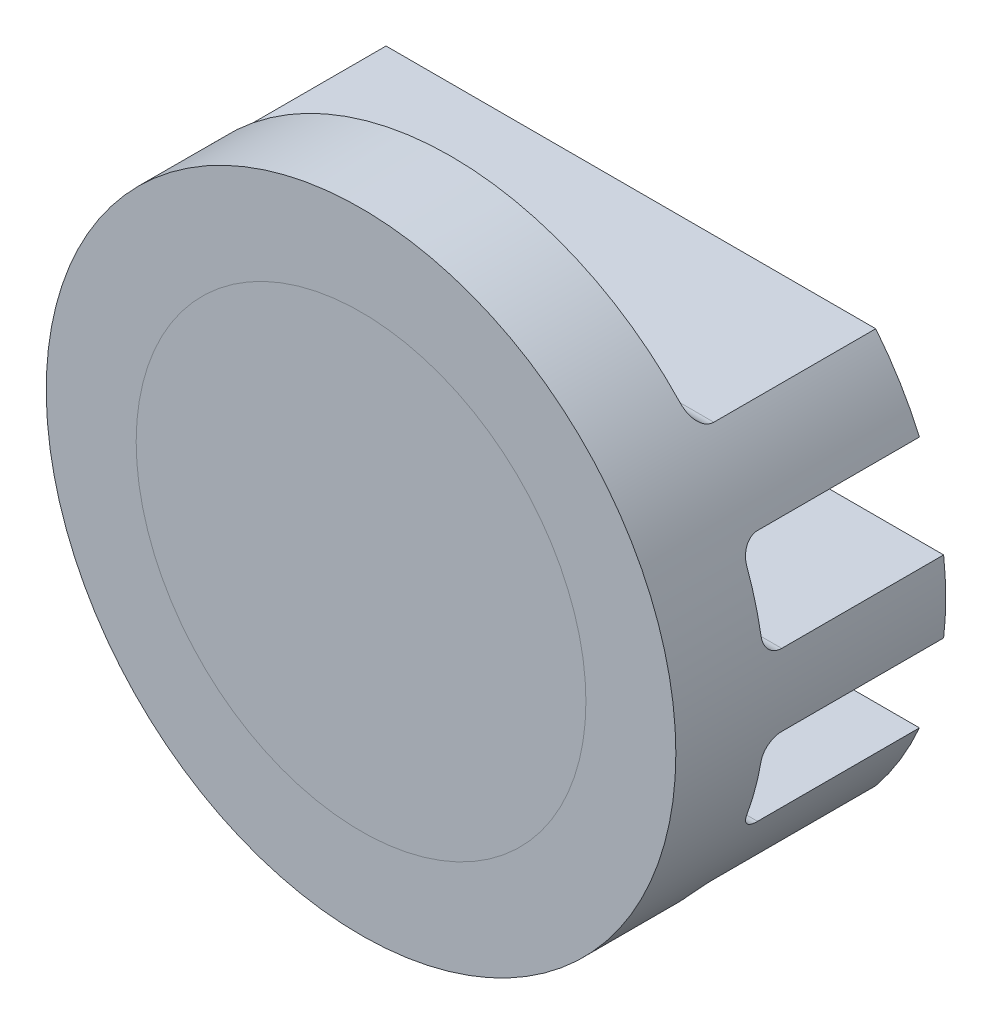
ISO-10303-21;
HEADER;
FILE_DESCRIPTION(('STEP AP214'),'2;1');
FILE_NAME('part.step','',(''),(''),'','','');
FILE_SCHEMA(('AUTOMOTIVE_DESIGN { 1 0 10303 214 1 1 1 1 }'));
ENDSEC;
DATA;
#1=APPLICATION_CONTEXT('core data for automotive mechanical design processes');
#2=APPLICATION_PROTOCOL_DEFINITION('international standard','automotive_design',2000,#1);
#3=PRODUCT_CONTEXT('',#1,'mechanical');
#4=PRODUCT('Part','Part','',(#3));
#5=PRODUCT_RELATED_PRODUCT_CATEGORY('part','',(#4));
#6=PRODUCT_DEFINITION_FORMATION('','',#4);
#7=PRODUCT_DEFINITION_CONTEXT('part definition',#1,'design');
#8=PRODUCT_DEFINITION('design','',#6,#7);
#9=PRODUCT_DEFINITION_SHAPE('','',#8);
#10=(LENGTH_UNIT() NAMED_UNIT(*) SI_UNIT(.MILLI.,.METRE.));
#11=(NAMED_UNIT(*) PLANE_ANGLE_UNIT() SI_UNIT($,.RADIAN.));
#12=(NAMED_UNIT(*) SI_UNIT($,.STERADIAN.) SOLID_ANGLE_UNIT());
#13=UNCERTAINTY_MEASURE_WITH_UNIT(LENGTH_MEASURE(1.E-05),#10,'distance_accuracy_value','');
#14=(GEOMETRIC_REPRESENTATION_CONTEXT(3) GLOBAL_UNCERTAINTY_ASSIGNED_CONTEXT((#13)) GLOBAL_UNIT_ASSIGNED_CONTEXT((#10,
#11,#12)) REPRESENTATION_CONTEXT('',''));
#15=CARTESIAN_POINT('',(0.,0.,0.));
#16=DIRECTION('',(0.,0.,1.));
#17=DIRECTION('',(1.,0.,0.));
#18=AXIS2_PLACEMENT_3D('',#15,#16,#17);
#19=CARTESIAN_POINT('',(0.,0.,10.));
#20=DIRECTION('',(0.,0.,1.));
#21=DIRECTION('',(1.,0.,0.));
#22=AXIS2_PLACEMENT_3D('',#19,#20,#21);
#23=PLANE('',#22);
#24=CARTESIAN_POINT('',(0.,0.,10.));
#25=DIRECTION('',(0.,0.,1.));
#26=DIRECTION('',(1.,0.,0.));
#27=AXIS2_PLACEMENT_3D('',#24,#25,#26);
#28=CIRCLE('',#27,35.);
#29=CARTESIAN_POINT('',(35.,0.,10.));
#30=VERTEX_POINT('',#29);
#31=EDGE_CURVE('E199',#30,#30,#28,.T.);
#32=ORIENTED_EDGE('',*,*,#31,.T.);
#33=EDGE_LOOP('',(#32));
#34=FACE_BOUND('',#33,.T.);
#35=CARTESIAN_POINT('',(0.,0.,10.));
#36=DIRECTION('',(0.,0.,1.));
#37=DIRECTION('',(1.,0.,0.));
#38=AXIS2_PLACEMENT_3D('',#35,#36,#37);
#39=CIRCLE('',#38,25.);
#40=CARTESIAN_POINT('',(25.,0.,10.));
#41=VERTEX_POINT('',#40);
#42=EDGE_CURVE('E12',#41,#41,#39,.F.);
#43=ORIENTED_EDGE('',*,*,#42,.T.);
#44=EDGE_LOOP('',(#43));
#45=FACE_BOUND('',#44,.T.);
#46=ADVANCED_FACE('F35',(#34,#45),#23,.T.);
#47=CARTESIAN_POINT('',(43.,-4.,-20.));
#48=DIRECTION('',(0.,1.,0.));
#49=DIRECTION('',(0.,0.,1.));
#50=AXIS2_PLACEMENT_3D('',#47,#48,#49);
#51=PLANE('',#50);
#52=DIRECTION('',(0.,0.,1.));
#53=VECTOR('',#52,1.);
#54=CARTESIAN_POINT('',(34.7706773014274,-4.,-20.));
#55=LINE('',#54,#53);
#56=CARTESIAN_POINT('',(34.7706773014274,-4.,-2.));
#57=VERTEX_POINT('',#56);
#58=CARTESIAN_POINT('',(34.7706773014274,-4.,-20.));
#59=VERTEX_POINT('',#58);
#60=EDGE_CURVE('E165',#57,#59,#55,.F.);
#61=ORIENTED_EDGE('',*,*,#60,.F.);
#62=DIRECTION('',(-1.,0.,0.));
#63=VECTOR('',#62,1.);
#64=CARTESIAN_POINT('',(-34.7706773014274,-4.,-2.));
#65=LINE('',#64,#63);
#66=CARTESIAN_POINT('',(-34.7706773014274,-4.,-2.));
#67=VERTEX_POINT('',#66);
#68=EDGE_CURVE('E220',#57,#67,#65,.T.);
#69=ORIENTED_EDGE('',*,*,#68,.T.);
#70=DIRECTION('',(0.,0.,1.));
#71=VECTOR('',#70,1.);
#72=CARTESIAN_POINT('',(-34.7706773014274,-4.,-20.));
#73=LINE('',#72,#71);
#74=CARTESIAN_POINT('',(-34.7706773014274,-4.,-20.));
#75=VERTEX_POINT('',#74);
#76=EDGE_CURVE('E528',#75,#67,#73,.T.);
#77=ORIENTED_EDGE('',*,*,#76,.F.);
#78=DIRECTION('',(-1.,0.,0.));
#79=VECTOR('',#78,1.);
#80=CARTESIAN_POINT('',(43.,-4.,-20.));
#81=LINE('',#80,#79);
#82=EDGE_CURVE('E187',#59,#75,#81,.T.);
#83=ORIENTED_EDGE('',*,*,#82,.F.);
#84=EDGE_LOOP('',(#61,#69,#77,#83));
#85=FACE_BOUND('',#84,.T.);
#86=ADVANCED_FACE('F284',(#85),#51,.F.);
#87=CARTESIAN_POINT('',(43.,4.,-20.));
#88=DIRECTION('',(0.,-1.,0.));
#89=DIRECTION('',(0.,0.,-1.));
#90=AXIS2_PLACEMENT_3D('',#87,#88,#89);
#91=PLANE('',#90);
#92=DIRECTION('',(0.,0.,1.));
#93=VECTOR('',#92,1.);
#94=CARTESIAN_POINT('',(-34.7706773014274,4.,-20.));
#95=LINE('',#94,#93);
#96=CARTESIAN_POINT('',(-34.7706773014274,4.,-2.));
#97=VERTEX_POINT('',#96);
#98=CARTESIAN_POINT('',(-34.7706773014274,4.,-20.));
#99=VERTEX_POINT('',#98);
#100=EDGE_CURVE('E516',#97,#99,#95,.F.);
#101=ORIENTED_EDGE('',*,*,#100,.F.);
#102=DIRECTION('',(1.,0.,0.));
#103=VECTOR('',#102,1.);
#104=CARTESIAN_POINT('',(34.7706773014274,4.,-2.));
#105=LINE('',#104,#103);
#106=CARTESIAN_POINT('',(34.7706773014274,4.,-2.));
#107=VERTEX_POINT('',#106);
#108=EDGE_CURVE('E180',#97,#107,#105,.T.);
#109=ORIENTED_EDGE('',*,*,#108,.T.);
#110=DIRECTION('',(0.,0.,1.));
#111=VECTOR('',#110,1.);
#112=CARTESIAN_POINT('',(34.7706773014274,4.,-20.));
#113=LINE('',#112,#111);
#114=CARTESIAN_POINT('',(34.7706773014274,4.,-20.));
#115=VERTEX_POINT('',#114);
#116=EDGE_CURVE('E163',#115,#107,#113,.T.);
#117=ORIENTED_EDGE('',*,*,#116,.F.);
#118=DIRECTION('',(1.,0.,0.));
#119=VECTOR('',#118,1.);
#120=CARTESIAN_POINT('',(43.,4.,-20.));
#121=LINE('',#120,#119);
#122=EDGE_CURVE('E178',#99,#115,#121,.T.);
#123=ORIENTED_EDGE('',*,*,#122,.F.);
#124=EDGE_LOOP('',(#101,#109,#117,#123));
#125=FACE_BOUND('',#124,.T.);
#126=ADVANCED_FACE('F177',(#125),#91,.F.);
#127=CARTESIAN_POINT('',(43.,4.,-20.));
#128=DIRECTION('',(0.,0.,1.));
#129=DIRECTION('',(1.,0.,0.));
#130=AXIS2_PLACEMENT_3D('',#127,#128,#129);
#131=PLANE('',#130);
#132=CARTESIAN_POINT('',(0.,0.,-20.));
#133=DIRECTION('',(0.,0.,1.));
#134=DIRECTION('',(1.,0.,0.));
#135=AXIS2_PLACEMENT_3D('',#132,#133,#134);
#136=CIRCLE('',#135,35.);
#137=EDGE_CURVE('E170',#99,#75,#136,.T.);
#138=ORIENTED_EDGE('',*,*,#137,.F.);
#139=ORIENTED_EDGE('',*,*,#122,.T.);
#140=EDGE_CURVE('E161',#59,#115,#136,.T.);
#141=ORIENTED_EDGE('',*,*,#140,.F.);
#142=ORIENTED_EDGE('',*,*,#82,.T.);
#143=EDGE_LOOP('',(#138,#139,#141,#142));
#144=FACE_BOUND('',#143,.T.);
#145=ADVANCED_FACE('F185',(#144),#131,.F.);
#146=CARTESIAN_POINT('',(43.,14.,-20.));
#147=DIRECTION('',(0.,1.,0.));
#148=DIRECTION('',(0.,0.,1.));
#149=AXIS2_PLACEMENT_3D('',#146,#147,#148);
#150=PLANE('',#149);
#151=DIRECTION('',(0.,0.,1.));
#152=VECTOR('',#151,1.);
#153=CARTESIAN_POINT('',(32.0780298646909,14.,-20.));
#154=LINE('',#153,#152);
#155=CARTESIAN_POINT('',(32.0780298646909,14.,-2.));
#156=VERTEX_POINT('',#155);
#157=CARTESIAN_POINT('',(32.0780298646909,14.,-20.));
#158=VERTEX_POINT('',#157);
#159=EDGE_CURVE('E181',#156,#158,#154,.F.);
#160=ORIENTED_EDGE('',*,*,#159,.F.);
#161=DIRECTION('',(-1.,0.,0.));
#162=VECTOR('',#161,1.);
#163=CARTESIAN_POINT('',(-32.0780298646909,14.,-2.));
#164=LINE('',#163,#162);
#165=CARTESIAN_POINT('',(-32.0780298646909,14.,-2.));
#166=VERTEX_POINT('',#165);
#167=EDGE_CURVE('E212',#156,#166,#164,.T.);
#168=ORIENTED_EDGE('',*,*,#167,.T.);
#169=DIRECTION('',(0.,0.,1.));
#170=VECTOR('',#169,1.);
#171=CARTESIAN_POINT('',(-32.0780298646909,14.,-20.));
#172=LINE('',#171,#170);
#173=CARTESIAN_POINT('',(-32.0780298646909,14.,-20.));
#174=VERTEX_POINT('',#173);
#175=EDGE_CURVE('E529',#174,#166,#172,.T.);
#176=ORIENTED_EDGE('',*,*,#175,.F.);
#177=DIRECTION('',(-1.,0.,0.));
#178=VECTOR('',#177,1.);
#179=CARTESIAN_POINT('',(43.,14.,-20.));
#180=LINE('',#179,#178);
#181=EDGE_CURVE('E541',#158,#174,#180,.T.);
#182=ORIENTED_EDGE('',*,*,#181,.F.);
#183=EDGE_LOOP('',(#160,#168,#176,#182));
#184=FACE_BOUND('',#183,.T.);
#185=ADVANCED_FACE('F275',(#184),#150,.F.);
#186=CARTESIAN_POINT('',(43.,22.,-20.));
#187=DIRECTION('',(0.,-1.,0.));
#188=DIRECTION('',(0.,0.,-1.));
#189=AXIS2_PLACEMENT_3D('',#186,#187,#188);
#190=PLANE('',#189);
#191=DIRECTION('',(0.,0.,1.));
#192=VECTOR('',#191,1.);
#193=CARTESIAN_POINT('',(-27.2213151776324,22.,-20.));
#194=LINE('',#193,#192);
#195=CARTESIAN_POINT('',(-27.2213151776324,22.,-2.));
#196=VERTEX_POINT('',#195);
#197=CARTESIAN_POINT('',(-27.2213151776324,22.,-20.));
#198=VERTEX_POINT('',#197);
#199=EDGE_CURVE('E507',#196,#198,#194,.F.);
#200=ORIENTED_EDGE('',*,*,#199,.F.);
#201=DIRECTION('',(1.,0.,0.));
#202=VECTOR('',#201,1.);
#203=CARTESIAN_POINT('',(27.2213151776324,22.,-2.));
#204=LINE('',#203,#202);
#205=CARTESIAN_POINT('',(27.2213151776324,22.,-2.));
#206=VERTEX_POINT('',#205);
#207=EDGE_CURVE('E207',#196,#206,#204,.T.);
#208=ORIENTED_EDGE('',*,*,#207,.T.);
#209=DIRECTION('',(0.,0.,1.));
#210=VECTOR('',#209,1.);
#211=CARTESIAN_POINT('',(27.2213151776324,22.,-20.));
#212=LINE('',#211,#210);
#213=CARTESIAN_POINT('',(27.2213151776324,22.,-20.));
#214=VERTEX_POINT('',#213);
#215=EDGE_CURVE('E182',#214,#206,#212,.T.);
#216=ORIENTED_EDGE('',*,*,#215,.F.);
#217=DIRECTION('',(1.,0.,0.));
#218=VECTOR('',#217,1.);
#219=CARTESIAN_POINT('',(43.,22.,-20.));
#220=LINE('',#219,#218);
#221=EDGE_CURVE('E194',#198,#214,#220,.T.);
#222=ORIENTED_EDGE('',*,*,#221,.F.);
#223=EDGE_LOOP('',(#200,#208,#216,#222));
#224=FACE_BOUND('',#223,.T.);
#225=ADVANCED_FACE('F271',(#224),#190,.F.);
#226=CARTESIAN_POINT('',(43.,22.,-20.));
#227=DIRECTION('',(0.,0.,1.));
#228=DIRECTION('',(1.,0.,0.));
#229=AXIS2_PLACEMENT_3D('',#226,#227,#228);
#230=PLANE('',#229);
#231=EDGE_CURVE('E172',#158,#214,#136,.T.);
#232=ORIENTED_EDGE('',*,*,#231,.F.);
#233=ORIENTED_EDGE('',*,*,#181,.T.);
#234=EDGE_CURVE('E545',#198,#174,#136,.T.);
#235=ORIENTED_EDGE('',*,*,#234,.F.);
#236=ORIENTED_EDGE('',*,*,#221,.T.);
#237=EDGE_LOOP('',(#232,#233,#235,#236));
#238=FACE_BOUND('',#237,.T.);
#239=ADVANCED_FACE('F268',(#238),#230,.F.);
#240=CARTESIAN_POINT('',(43.,-22.,-20.));
#241=DIRECTION('',(0.,-1.,0.));
#242=DIRECTION('',(0.,0.,-1.));
#243=AXIS2_PLACEMENT_3D('',#240,#241,#242);
#244=PLANE('',#243);
#245=DIRECTION('',(0.,0.,1.));
#246=VECTOR('',#245,1.);
#247=CARTESIAN_POINT('',(27.2213151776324,-22.,-20.));
#248=LINE('',#247,#246);
#249=CARTESIAN_POINT('',(27.2213151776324,-22.,-20.));
#250=VERTEX_POINT('',#249);
#251=CARTESIAN_POINT('',(27.2213151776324,-22.,-2.));
#252=VERTEX_POINT('',#251);
#253=EDGE_CURVE('E517',#250,#252,#248,.T.);
#254=ORIENTED_EDGE('',*,*,#253,.T.);
#255=DIRECTION('',(1.,0.,0.));
#256=VECTOR('',#255,1.);
#257=CARTESIAN_POINT('',(43.,-22.,-2.));
#258=LINE('',#257,#256);
#259=CARTESIAN_POINT('',(-27.2213151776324,-22.,-2.));
#260=VERTEX_POINT('',#259);
#261=EDGE_CURVE('E52',#252,#260,#258,.F.);
#262=ORIENTED_EDGE('',*,*,#261,.T.);
#263=DIRECTION('',(0.,0.,1.));
#264=VECTOR('',#263,1.);
#265=CARTESIAN_POINT('',(-27.2213151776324,-22.,-20.));
#266=LINE('',#265,#264);
#267=CARTESIAN_POINT('',(-27.2213151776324,-22.,-20.));
#268=VERTEX_POINT('',#267);
#269=EDGE_CURVE('E550',#260,#268,#266,.F.);
#270=ORIENTED_EDGE('',*,*,#269,.T.);
#271=DIRECTION('',(1.,0.,0.));
#272=VECTOR('',#271,1.);
#273=CARTESIAN_POINT('',(43.,-22.,-20.));
#274=LINE('',#273,#272);
#275=EDGE_CURVE('E531',#268,#250,#274,.T.);
#276=ORIENTED_EDGE('',*,*,#275,.T.);
#277=EDGE_LOOP('',(#254,#262,#270,#276));
#278=FACE_BOUND('',#277,.T.);
#279=ADVANCED_FACE('F264',(#278),#244,.T.);
#280=CARTESIAN_POINT('',(43.,-14.,-20.));
#281=DIRECTION('',(0.,1.,0.));
#282=DIRECTION('',(0.,0.,1.));
#283=AXIS2_PLACEMENT_3D('',#280,#281,#282);
#284=PLANE('',#283);
#285=DIRECTION('',(0.,0.,1.));
#286=VECTOR('',#285,1.);
#287=CARTESIAN_POINT('',(-32.0780298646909,-14.,-20.));
#288=LINE('',#287,#286);
#289=CARTESIAN_POINT('',(-32.0780298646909,-14.,-20.));
#290=VERTEX_POINT('',#289);
#291=CARTESIAN_POINT('',(-32.0780298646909,-14.,-2.));
#292=VERTEX_POINT('',#291);
#293=EDGE_CURVE('E552',#290,#292,#288,.T.);
#294=ORIENTED_EDGE('',*,*,#293,.T.);
#295=DIRECTION('',(-1.,0.,0.));
#296=VECTOR('',#295,1.);
#297=CARTESIAN_POINT('',(43.,-14.,-2.));
#298=LINE('',#297,#296);
#299=CARTESIAN_POINT('',(32.0780298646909,-14.,-2.));
#300=VERTEX_POINT('',#299);
#301=EDGE_CURVE('E228',#292,#300,#298,.F.);
#302=ORIENTED_EDGE('',*,*,#301,.T.);
#303=DIRECTION('',(0.,0.,1.));
#304=VECTOR('',#303,1.);
#305=CARTESIAN_POINT('',(32.0780298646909,-14.,-20.));
#306=LINE('',#305,#304);
#307=CARTESIAN_POINT('',(32.0780298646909,-14.,-20.));
#308=VERTEX_POINT('',#307);
#309=EDGE_CURVE('E547',#300,#308,#306,.F.);
#310=ORIENTED_EDGE('',*,*,#309,.T.);
#311=DIRECTION('',(-1.,0.,0.));
#312=VECTOR('',#311,1.);
#313=CARTESIAN_POINT('',(43.,-14.,-20.));
#314=LINE('',#313,#312);
#315=EDGE_CURVE('E538',#308,#290,#314,.T.);
#316=ORIENTED_EDGE('',*,*,#315,.T.);
#317=EDGE_LOOP('',(#294,#302,#310,#316));
#318=FACE_BOUND('',#317,.T.);
#319=ADVANCED_FACE('F260',(#318),#284,.T.);
#320=CARTESIAN_POINT('',(43.,-22.,-20.));
#321=DIRECTION('',(0.,0.,1.));
#322=DIRECTION('',(1.,0.,0.));
#323=AXIS2_PLACEMENT_3D('',#320,#321,#322);
#324=PLANE('',#323);
#325=CARTESIAN_POINT('',(0.,0.,-20.));
#326=DIRECTION('',(0.,0.,1.));
#327=DIRECTION('',(1.,0.,0.));
#328=AXIS2_PLACEMENT_3D('',#325,#326,#327);
#329=CIRCLE('',#328,35.);
#330=EDGE_CURVE('E206',#290,#268,#329,.T.);
#331=ORIENTED_EDGE('',*,*,#330,.F.);
#332=ORIENTED_EDGE('',*,*,#315,.F.);
#333=EDGE_CURVE('E202',#250,#308,#329,.T.);
#334=ORIENTED_EDGE('',*,*,#333,.F.);
#335=ORIENTED_EDGE('',*,*,#275,.F.);
#336=EDGE_LOOP('',(#331,#332,#334,#335));
#337=FACE_BOUND('',#336,.T.);
#338=ADVANCED_FACE('F255',(#337),#324,.F.);
#339=CARTESIAN_POINT('',(0.,0.,0.));
#340=DIRECTION('',(0.,0.,1.));
#341=DIRECTION('',(1.,0.,0.));
#342=AXIS2_PLACEMENT_3D('',#339,#340,#341);
#343=PLANE('',#342);
#344=CARTESIAN_POINT('',(0.,0.,0.));
#345=DIRECTION('',(0.,0.,1.));
#346=DIRECTION('',(1.,0.,0.));
#347=AXIS2_PLACEMENT_3D('',#344,#345,#346);
#348=CIRCLE('',#347,35.);
#349=CARTESIAN_POINT('',(-25.475478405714,-24.,0.));
#350=VERTEX_POINT('',#349);
#351=CARTESIAN_POINT('',(25.475478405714,-24.,0.));
#352=VERTEX_POINT('',#351);
#353=EDGE_CURVE('E190',#350,#352,#348,.T.);
#354=ORIENTED_EDGE('',*,*,#353,.F.);
#355=DIRECTION('',(1.,0.,0.));
#356=VECTOR('',#355,1.);
#357=CARTESIAN_POINT('',(0.,-24.,0.));
#358=LINE('',#357,#356);
#359=EDGE_CURVE('E230',#350,#352,#358,.T.);
#360=ORIENTED_EDGE('',*,*,#359,.T.);
#361=EDGE_LOOP('',(#354,#360));
#362=FACE_BOUND('',#361,.T.);
#363=ADVANCED_FACE('F259',(#362),#343,.F.);
#364=CARTESIAN_POINT('',(-32.8785644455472,12.,0.));
#365=VERTEX_POINT('',#364);
#366=CARTESIAN_POINT('',(-34.4818792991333,6.,0.));
#367=VERTEX_POINT('',#366);
#368=EDGE_CURVE('E192',#365,#367,#348,.T.);
#369=ORIENTED_EDGE('',*,*,#368,.F.);
#370=DIRECTION('',(-1.,0.,0.));
#371=VECTOR('',#370,1.);
#372=CARTESIAN_POINT('',(32.0780298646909,12.,0.));
#373=LINE('',#372,#371);
#374=CARTESIAN_POINT('',(32.8785644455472,12.,0.));
#375=VERTEX_POINT('',#374);
#376=EDGE_CURVE('E217',#365,#375,#373,.F.);
#377=ORIENTED_EDGE('',*,*,#376,.T.);
#378=CARTESIAN_POINT('',(34.4818792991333,6.,0.));
#379=VERTEX_POINT('',#378);
#380=EDGE_CURVE('E203',#379,#375,#348,.T.);
#381=ORIENTED_EDGE('',*,*,#380,.F.);
#382=DIRECTION('',(1.,0.,0.));
#383=VECTOR('',#382,1.);
#384=CARTESIAN_POINT('',(-34.7706773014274,6.,0.));
#385=LINE('',#384,#383);
#386=EDGE_CURVE('E215',#379,#367,#385,.F.);
#387=ORIENTED_EDGE('',*,*,#386,.T.);
#388=EDGE_LOOP('',(#369,#377,#381,#387));
#389=FACE_BOUND('',#388,.T.);
#390=ADVANCED_FACE('F288',(#389),#343,.F.);
#391=CARTESIAN_POINT('',(25.475478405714,24.,0.));
#392=VERTEX_POINT('',#391);
#393=CARTESIAN_POINT('',(-25.475478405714,24.,0.));
#394=VERTEX_POINT('',#393);
#395=EDGE_CURVE('E198',#392,#394,#348,.T.);
#396=ORIENTED_EDGE('',*,*,#395,.F.);
#397=DIRECTION('',(1.,0.,0.));
#398=VECTOR('',#397,1.);
#399=CARTESIAN_POINT('',(-27.2213151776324,24.,0.));
#400=LINE('',#399,#398);
#401=EDGE_CURVE('E210',#392,#394,#400,.F.);
#402=ORIENTED_EDGE('',*,*,#401,.T.);
#403=EDGE_LOOP('',(#396,#402));
#404=FACE_BOUND('',#403,.T.);
#405=ADVANCED_FACE('F290',(#404),#343,.F.);
#406=CARTESIAN_POINT('',(-34.4818792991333,-6.,0.));
#407=VERTEX_POINT('',#406);
#408=CARTESIAN_POINT('',(-32.8785644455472,-12.,0.));
#409=VERTEX_POINT('',#408);
#410=EDGE_CURVE('E193',#407,#409,#348,.T.);
#411=ORIENTED_EDGE('',*,*,#410,.F.);
#412=DIRECTION('',(-1.,0.,0.));
#413=VECTOR('',#412,1.);
#414=CARTESIAN_POINT('',(34.7706773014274,-6.,0.));
#415=LINE('',#414,#413);
#416=CARTESIAN_POINT('',(34.4818792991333,-6.,0.));
#417=VERTEX_POINT('',#416);
#418=EDGE_CURVE('E226',#407,#417,#415,.F.);
#419=ORIENTED_EDGE('',*,*,#418,.T.);
#420=CARTESIAN_POINT('',(32.8785644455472,-12.,0.));
#421=VERTEX_POINT('',#420);
#422=EDGE_CURVE('E186',#421,#417,#348,.T.);
#423=ORIENTED_EDGE('',*,*,#422,.F.);
#424=DIRECTION('',(-1.,0.,0.));
#425=VECTOR('',#424,1.);
#426=CARTESIAN_POINT('',(0.,-12.,0.));
#427=LINE('',#426,#425);
#428=EDGE_CURVE('E223',#421,#409,#427,.T.);
#429=ORIENTED_EDGE('',*,*,#428,.T.);
#430=EDGE_LOOP('',(#411,#419,#423,#429));
#431=FACE_BOUND('',#430,.T.);
#432=ADVANCED_FACE('F292',(#431),#343,.F.);
#433=CARTESIAN_POINT('',(0.,0.,10.));
#434=DIRECTION('',(0.,0.,-1.));
#435=DIRECTION('',(-1.,0.,0.));
#436=AXIS2_PLACEMENT_3D('',#433,#434,#435);
#437=CYLINDRICAL_SURFACE('',#436,35.);
#438=ORIENTED_EDGE('',*,*,#31,.F.);
#439=EDGE_LOOP('',(#438));
#440=FACE_BOUND('',#439,.T.);
#441=ORIENTED_EDGE('',*,*,#116,.T.);
#442=CARTESIAN_POINT('',(34.7706773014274,4.,-2.));
#443=CARTESIAN_POINT('',(34.770676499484,4.00000018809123,-1.94404006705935));
#444=CARTESIAN_POINT('',(34.7704070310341,4.00235013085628,-1.88810699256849));
#445=CARTESIAN_POINT('',(34.7693270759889,4.01172376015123,-1.77664227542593));
#446=CARTESIAN_POINT('',(34.7685166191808,4.01874718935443,-1.72111061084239));
#447=CARTESIAN_POINT('',(34.7652720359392,4.0467562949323,-1.55582564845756));
#448=CARTESIAN_POINT('',(34.7620247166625,4.07468100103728,-1.44718144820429));
#449=CARTESIAN_POINT('',(34.7533243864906,4.14822840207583,-1.23616117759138));
#450=CARTESIAN_POINT('',(34.7478703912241,4.1938589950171,-1.13378792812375));
#451=CARTESIAN_POINT('',(34.7347132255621,4.30146761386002,-0.93819121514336));
#452=CARTESIAN_POINT('',(34.7270103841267,4.36344324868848,-0.844966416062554));
#453=CARTESIAN_POINT('',(34.7093131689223,4.50205004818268,-0.670105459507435));
#454=CARTESIAN_POINT('',(34.6993145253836,4.57870847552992,-0.588491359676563));
#455=CARTESIAN_POINT('',(34.6770513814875,4.7443732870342,-0.439285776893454));
#456=CARTESIAN_POINT('',(34.6647864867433,4.83338181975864,-0.371696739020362));
#457=CARTESIAN_POINT('',(34.6380026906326,5.02173930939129,-0.251989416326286));
#458=CARTESIAN_POINT('',(34.6234700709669,5.12114989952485,-0.199971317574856));
#459=CARTESIAN_POINT('',(34.592399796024,5.32697713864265,-0.113337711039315));
#460=CARTESIAN_POINT('',(34.5758628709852,5.43339122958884,-0.078715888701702));
#461=CARTESIAN_POINT('',(34.5464284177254,5.61694672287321,-0.0355031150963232));
#462=CARTESIAN_POINT('',(34.5339655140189,5.69308232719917,-0.0221886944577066));
#463=CARTESIAN_POINT('',(34.508384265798,5.84615233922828,-0.00443801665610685));
#464=CARTESIAN_POINT('',(34.4952669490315,5.92308535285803,1.17387582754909E-05));
#465=CARTESIAN_POINT('',(34.4818792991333,6.,0.));
#466=B_SPLINE_CURVE_WITH_KNOTS('',3,(#442,#443,#444,#445,#446,#447,#448,#449,#450,#451,#452,
#453,#454,#455,#456,#457,#458,#459,#460,#461,#462,#463,#464,#465),.UNSPECIFIED.,.F.,.F.,(4,2,2,
2,2,2,2,2,2,2,2,4),(0.,0.167776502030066,0.335543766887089,0.670483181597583,1.00557217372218,
1.34061217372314,1.67628040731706,2.0120071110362,2.34984966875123,2.68756950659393,
2.92195601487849,3.15598534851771),.UNSPECIFIED.);
#467=EDGE_CURVE('E479',#107,#379,#466,.T.);
#468=ORIENTED_EDGE('',*,*,#467,.T.);
#469=ORIENTED_EDGE('',*,*,#380,.T.);
#470=CARTESIAN_POINT('',(32.8785644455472,12.,0.));
#471=CARTESIAN_POINT('',(32.8567375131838,12.0598059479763,-2.54975750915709E-06));
#472=CARTESIAN_POINT('',(32.8347564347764,12.1195214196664,-0.00268385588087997));
#473=CARTESIAN_POINT('',(32.7906280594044,12.238411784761,-0.0133628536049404));
#474=CARTESIAN_POINT('',(32.7684807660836,12.2975866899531,-0.021360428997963));
#475=CARTESIAN_POINT('',(32.7020073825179,12.4737487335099,-0.0532630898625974));
#476=CARTESIAN_POINT('',(32.6576436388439,12.5893900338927,-0.0850781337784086));
#477=CARTESIAN_POINT('',(32.5703141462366,12.8136318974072,-0.169053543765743));
#478=CARTESIAN_POINT('',(32.5273492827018,12.9222280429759,-0.221226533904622));
#479=CARTESIAN_POINT('',(32.4443956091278,13.1291129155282,-0.344825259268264));
#480=CARTESIAN_POINT('',(32.4044055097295,13.2274061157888,-0.416242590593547));
#481=CARTESIAN_POINT('',(32.3299365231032,13.4083774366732,-0.574994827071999));
#482=CARTESIAN_POINT('',(32.2953544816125,13.4913553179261,-0.661938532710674));
#483=CARTESIAN_POINT('',(32.232331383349,13.6412405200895,-0.850724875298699));
#484=CARTESIAN_POINT('',(32.2038894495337,13.7081501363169,-0.952565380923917));
#485=CARTESIAN_POINT('',(32.1565315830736,13.8188588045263,-1.16056427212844));
#486=CARTESIAN_POINT('',(32.1370855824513,13.8639542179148,-1.26591258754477));
#487=CARTESIAN_POINT('',(32.1060821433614,13.9356033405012,-1.48374243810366));
#488=CARTESIAN_POINT('',(32.0945098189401,13.9621920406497,-1.59621007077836));
#489=CARTESIAN_POINT('',(32.0841707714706,13.9859225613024,-1.75818304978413));
#490=CARTESIAN_POINT('',(32.0818694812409,13.9911996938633,-1.80639970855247));
#491=CARTESIAN_POINT('',(32.0788001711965,13.9982352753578,-1.9030686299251));
#492=CARTESIAN_POINT('',(32.0780299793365,13.9999987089,-1.95152046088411));
#493=CARTESIAN_POINT('',(32.0780298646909,14.,-2.));
#494=B_SPLINE_CURVE_WITH_KNOTS('',3,(#470,#471,#472,#473,#474,#475,#476,#477,#478,#479,#480,
#481,#482,#483,#484,#485,#486,#487,#488,#489,#490,#491,#492,#493),.UNSPECIFIED.,.F.,.F.,(4,2,2,
2,2,2,2,2,2,2,2,4),(0.,0.190873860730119,0.38174354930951,0.763429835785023,1.14535318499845,
1.5271100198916,1.90033924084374,2.27351511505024,2.6203923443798,2.96661193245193,
3.11216426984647,3.25750997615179),.UNSPECIFIED.);
#495=EDGE_CURVE('E490',#375,#156,#494,.T.);
#496=ORIENTED_EDGE('',*,*,#495,.T.);
#497=ORIENTED_EDGE('',*,*,#159,.T.);
#498=ORIENTED_EDGE('',*,*,#231,.T.);
#499=ORIENTED_EDGE('',*,*,#215,.T.);
#500=CARTESIAN_POINT('',(27.2213151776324,22.,-2.));
#501=CARTESIAN_POINT('',(27.2213222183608,21.9999899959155,-1.95280063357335));
#502=CARTESIAN_POINT('',(27.2199650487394,22.0016705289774,-1.90560753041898));
#503=CARTESIAN_POINT('',(27.2145764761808,22.0083361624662,-1.81163213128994));
#504=CARTESIAN_POINT('',(27.210546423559,22.0133195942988,-1.76484963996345));
#505=CARTESIAN_POINT('',(27.1998984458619,22.0264747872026,-1.67232577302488));
#506=CARTESIAN_POINT('',(27.1932963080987,22.0346270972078,-1.62657981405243));
#507=CARTESIAN_POINT('',(27.1776070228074,22.0539754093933,-1.53618088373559));
#508=CARTESIAN_POINT('',(27.1685196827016,22.0651716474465,-1.49152799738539));
#509=CARTESIAN_POINT('',(27.1377406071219,22.1030337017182,-1.35982018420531));
#510=CARTESIAN_POINT('',(27.1125030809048,22.1340085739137,-1.2747732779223));
#511=CARTESIAN_POINT('',(27.0537782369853,22.2057474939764,-1.11196467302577));
#512=CARTESIAN_POINT('',(27.0202798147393,22.2465247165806,-1.03421297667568));
#513=CARTESIAN_POINT('',(26.9437634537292,22.3391461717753,-0.881946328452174));
#514=CARTESIAN_POINT('',(26.9002449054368,22.3915634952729,-0.808034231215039));
#515=CARTESIAN_POINT('',(26.8067869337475,22.5033664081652,-0.670351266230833));
#516=CARTESIAN_POINT('',(26.7568467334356,22.5627528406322,-0.606581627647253));
#517=CARTESIAN_POINT('',(26.6248974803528,22.7184911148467,-0.459091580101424));
#518=CARTESIAN_POINT('',(26.539560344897,22.8182018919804,-0.381872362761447));
#519=CARTESIAN_POINT('',(26.3603969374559,23.0249493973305,-0.249447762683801));
#520=CARTESIAN_POINT('',(26.2665372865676,23.1320144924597,-0.194333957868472));
#521=CARTESIAN_POINT('',(26.1144699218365,23.3032506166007,-0.12407469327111));
#522=CARTESIAN_POINT('',(26.0580900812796,23.3662840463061,-0.101901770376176));
#523=CARTESIAN_POINT('',(25.9438580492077,23.4930521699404,-0.0641855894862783));
#524=CARTESIAN_POINT('',(25.8860053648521,23.5567870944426,-0.0486445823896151));
#525=CARTESIAN_POINT('',(25.7697572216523,23.6838965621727,-0.0240867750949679));
#526=CARTESIAN_POINT('',(25.7113717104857,23.747268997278,-0.0150110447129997));
#527=CARTESIAN_POINT('',(25.5938924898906,23.8738383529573,-0.00297434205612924));
#528=CARTESIAN_POINT('',(25.5347994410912,23.9370353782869,-8.05451722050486E-06));
#529=CARTESIAN_POINT('',(25.475478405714,24.,0.));
#530=B_SPLINE_CURVE_WITH_KNOTS('',3,(#500,#501,#502,#503,#504,#505,#506,#507,#508,#509,#510,
#511,#512,#513,#514,#515,#516,#517,#518,#519,#520,#521,#522,#523,#524,#525,#526,#527,#528,#529),
.UNSPECIFIED.,.F.,.F.,(4,2,2,2,2,2,2,2,2,2,2,2,2,2,4),(0.,0.141538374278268,0.283005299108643,
0.423617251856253,0.56424010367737,0.844754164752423,1.12564737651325,1.42610944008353,
1.72660788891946,2.18095596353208,2.63716732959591,2.89921476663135,3.16135107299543,
3.42106635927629,3.68055559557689),.UNSPECIFIED.);
#531=EDGE_CURVE('E234',#206,#392,#530,.T.);
#532=ORIENTED_EDGE('',*,*,#531,.T.);
#533=ORIENTED_EDGE('',*,*,#395,.T.);
#534=CARTESIAN_POINT('',(-25.475478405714,24.,0.));
#535=CARTESIAN_POINT('',(-25.533136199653,23.9388004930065,-7.24315117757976E-06));
#536=CARTESIAN_POINT('',(-25.5905781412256,23.8773823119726,-0.00280986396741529));
#537=CARTESIAN_POINT('',(-25.7047973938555,23.7543765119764,-0.0141763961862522));
#538=CARTESIAN_POINT('',(-25.7615741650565,23.6927887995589,-0.0227446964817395));
#539=CARTESIAN_POINT('',(-25.874579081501,23.5693279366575,-0.0459033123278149));
#540=CARTESIAN_POINT('',(-25.9307995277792,23.5074562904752,-0.0605399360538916));
#541=CARTESIAN_POINT('',(-26.0418851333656,23.3843345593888,-0.0960406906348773));
#542=CARTESIAN_POINT('',(-26.0967506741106,23.3230843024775,-0.116903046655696));
#543=CARTESIAN_POINT('',(-26.2464819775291,23.1547582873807,-0.183694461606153));
#544=CARTESIAN_POINT('',(-26.3395887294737,23.0487442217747,-0.236550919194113));
#545=CARTESIAN_POINT('',(-26.5177862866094,22.8434981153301,-0.363837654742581));
#546=CARTESIAN_POINT('',(-26.6028992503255,22.744247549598,-0.438205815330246));
#547=CARTESIAN_POINT('',(-26.744639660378,22.5772791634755,-0.590843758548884));
#548=CARTESIAN_POINT('',(-26.8034317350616,22.5074044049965,-0.664727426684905));
#549=CARTESIAN_POINT('',(-26.9121598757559,22.3772836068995,-0.826322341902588));
#550=CARTESIAN_POINT('',(-26.9621030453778,22.3170298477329,-0.91402238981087));
#551=CARTESIAN_POINT('',(-27.0432813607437,22.2185579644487,-1.08643358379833));
#552=CARTESIAN_POINT('',(-27.0762491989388,22.1783390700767,-1.16918059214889));
#553=CARTESIAN_POINT('',(-27.1328826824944,22.109018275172,-1.34210029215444));
#554=CARTESIAN_POINT('',(-27.1565642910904,22.0798972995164,-1.43225991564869));
#555=CARTESIAN_POINT('',(-27.1901715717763,22.0384925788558,-1.60162359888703));
#556=CARTESIAN_POINT('',(-27.2017777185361,22.0241560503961,-1.67998962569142));
#557=CARTESIAN_POINT('',(-27.2134615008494,22.0097148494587,-1.79905868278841));
#558=CARTESIAN_POINT('',(-27.2164019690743,22.0060782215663,-1.83908957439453));
#559=CARTESIAN_POINT('',(-27.2203301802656,22.0012188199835,-1.91940869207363));
#560=CARTESIAN_POINT('',(-27.2213171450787,21.9999970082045,-1.95969701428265));
#561=CARTESIAN_POINT('',(-27.2213151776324,22.,-2.));
#562=B_SPLINE_CURVE_WITH_KNOTS('',3,(#534,#535,#536,#537,#538,#539,#540,#541,#542,#543,#544,
#545,#546,#547,#548,#549,#550,#551,#552,#553,#554,#555,#556,#557,#558,#559,#560,#561),
.UNSPECIFIED.,.F.,.F.,(4,2,2,2,2,2,2,2,2,2,2,2,2,4),(0.,0.252215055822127,0.504622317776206,
0.758992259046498,1.01328975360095,1.46356423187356,1.91255125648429,2.26364318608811,
2.61445198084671,2.90644391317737,3.19793168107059,3.43849242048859,3.55929428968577,
3.68014426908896),.UNSPECIFIED.);
#563=EDGE_CURVE('E240',#394,#196,#562,.T.);
#564=ORIENTED_EDGE('',*,*,#563,.T.);
#565=ORIENTED_EDGE('',*,*,#199,.T.);
#566=ORIENTED_EDGE('',*,*,#234,.T.);
#567=ORIENTED_EDGE('',*,*,#175,.T.);
#568=CARTESIAN_POINT('',(-32.0780298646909,14.,-2.));
#569=CARTESIAN_POINT('',(-32.0780254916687,14.0000076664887,-1.94697972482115));
#570=CARTESIAN_POINT('',(-32.0789499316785,13.9978918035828,-1.89396375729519));
#571=CARTESIAN_POINT('',(-32.082623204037,13.9894720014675,-1.788341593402));
#572=CARTESIAN_POINT('',(-32.0853715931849,13.9831690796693,-1.73573530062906));
#573=CARTESIAN_POINT('',(-32.0926480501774,13.9664605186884,-1.63147242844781));
#574=CARTESIAN_POINT('',(-32.0971704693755,13.9560679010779,-1.57981337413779));
#575=CARTESIAN_POINT('',(-32.1079280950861,13.9313005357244,-1.47765459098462));
#576=CARTESIAN_POINT('',(-32.1141633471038,13.9169256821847,-1.42715489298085));
#577=CARTESIAN_POINT('',(-32.1353176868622,13.8680435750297,-1.27796587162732));
#578=CARTESIAN_POINT('',(-32.1526956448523,13.8277553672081,-1.18144289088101));
#579=CARTESIAN_POINT('',(-32.1931508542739,13.733304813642,-0.996785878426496));
#580=CARTESIAN_POINT('',(-32.2162311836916,13.6791349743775,-0.908656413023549));
#581=CARTESIAN_POINT('',(-32.2680543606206,13.5564469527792,-0.739530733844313));
#582=CARTESIAN_POINT('',(-32.2969763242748,13.4874689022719,-0.65892325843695));
#583=CARTESIAN_POINT('',(-32.3587440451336,13.3385972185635,-0.510290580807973));
#584=CARTESIAN_POINT('',(-32.3915910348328,13.2587001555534,-0.442269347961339));
#585=CARTESIAN_POINT('',(-32.4627646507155,13.0835206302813,-0.31519042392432));
#586=CARTESIAN_POINT('',(-32.5013188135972,12.9875244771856,-0.257243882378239));
#587=CARTESIAN_POINT('',(-32.5803880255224,12.7878792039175,-0.158353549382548));
#588=CARTESIAN_POINT('',(-32.6209034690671,12.6842285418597,-0.117413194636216));
#589=CARTESIAN_POINT('',(-32.6978539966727,12.4844050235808,-0.0570846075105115));
#590=CARTESIAN_POINT('',(-32.7342075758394,12.3887894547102,-0.0357257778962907));
#591=CARTESIAN_POINT('',(-32.8067116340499,12.195512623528,-0.00718045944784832));
#592=CARTESIAN_POINT('',(-32.8428622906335,12.0978536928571,2.13781106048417E-05));
#593=CARTESIAN_POINT('',(-32.8785644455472,12.,0.));
#594=B_SPLINE_CURVE_WITH_KNOTS('',3,(#568,#569,#570,#571,#572,#573,#574,#575,#576,#577,#578,
#579,#580,#581,#582,#583,#584,#585,#586,#587,#588,#589,#590,#591,#592,#593),.UNSPECIFIED.,.F.,
.F.,(4,2,2,2,2,2,2,2,2,2,2,2,4),(0.,0.159003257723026,0.317967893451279,0.476430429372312,
0.634897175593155,0.951398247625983,1.26807053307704,1.59655595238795,1.92514479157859,
2.27933253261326,2.63359181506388,2.94612292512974,3.25831500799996),.UNSPECIFIED.);
#595=EDGE_CURVE('E493',#166,#365,#594,.T.);
#596=ORIENTED_EDGE('',*,*,#595,.T.);
#597=ORIENTED_EDGE('',*,*,#368,.T.);
#598=CARTESIAN_POINT('',(-34.4818792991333,6.,0.));
#599=CARTESIAN_POINT('',(-34.4917063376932,5.94352869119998,-7.76788104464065E-07));
#600=CARTESIAN_POINT('',(-34.5013884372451,5.88705891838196,-0.00239329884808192));
#601=CARTESIAN_POINT('',(-34.5204112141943,5.77446640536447,-0.011953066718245));
#602=CARTESIAN_POINT('',(-34.5297518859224,5.7183436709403,-0.0191203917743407));
#603=CARTESIAN_POINT('',(-34.557162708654,5.55114441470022,-0.0477491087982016));
#604=CARTESIAN_POINT('',(-34.5746447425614,5.44110401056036,-0.0763372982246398));
#605=CARTESIAN_POINT('',(-34.6076382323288,5.22715369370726,-0.151864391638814));
#606=CARTESIAN_POINT('',(-34.6231481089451,5.12324872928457,-0.198817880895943));
#607=CARTESIAN_POINT('',(-34.6519457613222,4.9247047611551,-0.309833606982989));
#608=CARTESIAN_POINT('',(-34.6652343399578,4.83006241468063,-0.373889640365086));
#609=CARTESIAN_POINT('',(-34.6893488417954,4.65370223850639,-0.516679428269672));
#610=CARTESIAN_POINT('',(-34.700196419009,4.5718728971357,-0.595271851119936));
#611=CARTESIAN_POINT('',(-34.7195466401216,4.42252945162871,-0.765337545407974));
#612=CARTESIAN_POINT('',(-34.7280488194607,4.35501818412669,-0.856813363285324));
#613=CARTESIAN_POINT('',(-34.7426519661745,4.2369392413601,-1.04908854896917));
#614=CARTESIAN_POINT('',(-34.748774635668,4.18621908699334,-1.1497927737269));
#615=CARTESIAN_POINT('',(-34.7587706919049,4.10239616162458,-1.35835493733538));
#616=CARTESIAN_POINT('',(-34.7626456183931,4.06928133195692,-1.46620792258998));
#617=CARTESIAN_POINT('',(-34.767176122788,4.03034642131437,-1.6456632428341));
#618=CARTESIAN_POINT('',(-34.7684908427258,4.01897295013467,-1.71609353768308));
#619=CARTESIAN_POINT('',(-34.770240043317,4.00380132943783,-1.85767229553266));
#620=CARTESIAN_POINT('',(-34.7706758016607,3.99999218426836,-1.92881956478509));
#621=CARTESIAN_POINT('',(-34.7706773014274,4.,-2.));
#622=B_SPLINE_CURVE_WITH_KNOTS('',3,(#598,#599,#600,#601,#602,#603,#604,#605,#606,#607,#608,
#609,#610,#611,#612,#613,#614,#615,#616,#617,#618,#619,#620,#621),.UNSPECIFIED.,.F.,.F.,(4,2,2,
2,2,2,2,2,2,2,2,4),(0.,0.171856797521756,0.343716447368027,0.687036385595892,1.03062953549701,
1.37409822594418,1.71438805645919,2.05474524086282,2.39192098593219,2.72886548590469,
2.94254969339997,3.15592305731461),.UNSPECIFIED.);
#623=EDGE_CURVE('E484',#367,#97,#622,.T.);
#624=ORIENTED_EDGE('',*,*,#623,.T.);
#625=ORIENTED_EDGE('',*,*,#100,.T.);
#626=ORIENTED_EDGE('',*,*,#137,.T.);
#627=ORIENTED_EDGE('',*,*,#76,.T.);
#628=CARTESIAN_POINT('',(-34.7706773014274,-4.,-2.));
#629=CARTESIAN_POINT('',(-34.770676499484,-4.00000018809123,-1.94404006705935));
#630=CARTESIAN_POINT('',(-34.7704070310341,-4.00235013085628,-1.88810699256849));
#631=CARTESIAN_POINT('',(-34.7693270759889,-4.01172376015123,-1.77664227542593));
#632=CARTESIAN_POINT('',(-34.7685166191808,-4.01874718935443,-1.72111061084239));
#633=CARTESIAN_POINT('',(-34.7652720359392,-4.0467562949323,-1.55582564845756));
#634=CARTESIAN_POINT('',(-34.7620247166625,-4.07468100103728,-1.44718144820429));
#635=CARTESIAN_POINT('',(-34.7533243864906,-4.14822840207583,-1.23616117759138));
#636=CARTESIAN_POINT('',(-34.7478703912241,-4.1938589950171,-1.13378792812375));
#637=CARTESIAN_POINT('',(-34.7347132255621,-4.30146761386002,-0.93819121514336));
#638=CARTESIAN_POINT('',(-34.7270103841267,-4.36344324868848,-0.844966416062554));
#639=CARTESIAN_POINT('',(-34.7093131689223,-4.50205004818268,-0.670105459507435));
#640=CARTESIAN_POINT('',(-34.6993145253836,-4.57870847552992,-0.588491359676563));
#641=CARTESIAN_POINT('',(-34.6770513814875,-4.7443732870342,-0.439285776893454));
#642=CARTESIAN_POINT('',(-34.6647864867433,-4.83338181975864,-0.371696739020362));
#643=CARTESIAN_POINT('',(-34.6380026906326,-5.02173930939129,-0.251989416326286));
#644=CARTESIAN_POINT('',(-34.6234700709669,-5.12114989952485,-0.199971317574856));
#645=CARTESIAN_POINT('',(-34.592399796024,-5.32697713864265,-0.113337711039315));
#646=CARTESIAN_POINT('',(-34.5758628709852,-5.43339122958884,-0.078715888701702));
#647=CARTESIAN_POINT('',(-34.5464284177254,-5.61694672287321,-0.0355031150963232));
#648=CARTESIAN_POINT('',(-34.5339655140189,-5.69308232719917,-0.0221886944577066));
#649=CARTESIAN_POINT('',(-34.508384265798,-5.84615233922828,-0.00443801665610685));
#650=CARTESIAN_POINT('',(-34.4952669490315,-5.92308535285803,1.17387582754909E-05));
#651=CARTESIAN_POINT('',(-34.4818792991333,-6.,0.));
#652=B_SPLINE_CURVE_WITH_KNOTS('',3,(#628,#629,#630,#631,#632,#633,#634,#635,#636,#637,#638,
#639,#640,#641,#642,#643,#644,#645,#646,#647,#648,#649,#650,#651),.UNSPECIFIED.,.F.,.F.,(4,2,2,
2,2,2,2,2,2,2,2,4),(0.,0.167776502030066,0.335543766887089,0.670483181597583,1.00557217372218,
1.34061217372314,1.67628040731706,2.0120071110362,2.34984966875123,2.68756950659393,
2.92195601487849,3.15598534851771),.UNSPECIFIED.);
#653=EDGE_CURVE('E469',#67,#407,#652,.T.);
#654=ORIENTED_EDGE('',*,*,#653,.T.);
#655=ORIENTED_EDGE('',*,*,#410,.T.);
#656=CARTESIAN_POINT('',(-32.8785644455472,-12.,0.));
#657=CARTESIAN_POINT('',(-32.8567375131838,-12.0598059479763,-2.54975750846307E-06));
#658=CARTESIAN_POINT('',(-32.8347564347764,-12.1195214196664,-0.00268385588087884));
#659=CARTESIAN_POINT('',(-32.7906280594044,-12.238411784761,-0.0133628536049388));
#660=CARTESIAN_POINT('',(-32.7684807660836,-12.2975866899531,-0.0213604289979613));
#661=CARTESIAN_POINT('',(-32.7020073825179,-12.4737487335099,-0.0532630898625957));
#662=CARTESIAN_POINT('',(-32.6576436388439,-12.5893900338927,-0.0850781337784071));
#663=CARTESIAN_POINT('',(-32.5703141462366,-12.8136318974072,-0.169053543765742));
#664=CARTESIAN_POINT('',(-32.5273492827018,-12.9222280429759,-0.221226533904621));
#665=CARTESIAN_POINT('',(-32.4443956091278,-13.1291129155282,-0.344825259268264));
#666=CARTESIAN_POINT('',(-32.4044055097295,-13.2274061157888,-0.416242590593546));
#667=CARTESIAN_POINT('',(-32.3299365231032,-13.4083774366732,-0.574994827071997));
#668=CARTESIAN_POINT('',(-32.2953544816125,-13.4913553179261,-0.661938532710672));
#669=CARTESIAN_POINT('',(-32.232331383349,-13.6412405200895,-0.850724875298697));
#670=CARTESIAN_POINT('',(-32.2038894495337,-13.7081501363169,-0.952565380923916));
#671=CARTESIAN_POINT('',(-32.1565315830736,-13.8188588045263,-1.16056427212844));
#672=CARTESIAN_POINT('',(-32.1370855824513,-13.8639542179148,-1.26591258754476));
#673=CARTESIAN_POINT('',(-32.1060821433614,-13.9356033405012,-1.48374243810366));
#674=CARTESIAN_POINT('',(-32.0945098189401,-13.9621920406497,-1.59621007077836));
#675=CARTESIAN_POINT('',(-32.0841707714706,-13.9859225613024,-1.75818304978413));
#676=CARTESIAN_POINT('',(-32.0818694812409,-13.9911996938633,-1.80639970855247));
#677=CARTESIAN_POINT('',(-32.0788001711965,-13.9982352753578,-1.9030686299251));
#678=CARTESIAN_POINT('',(-32.0780299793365,-13.9999987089,-1.95152046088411));
#679=CARTESIAN_POINT('',(-32.0780298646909,-14.,-2.));
#680=B_SPLINE_CURVE_WITH_KNOTS('',3,(#656,#657,#658,#659,#660,#661,#662,#663,#664,#665,#666,
#667,#668,#669,#670,#671,#672,#673,#674,#675,#676,#677,#678,#679),.UNSPECIFIED.,.F.,.F.,(4,2,2,
2,2,2,2,2,2,2,2,4),(0.,0.190873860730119,0.38174354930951,0.763429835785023,1.14535318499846,
1.5271100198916,1.90033924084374,2.27351511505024,2.6203923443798,2.96661193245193,
3.11216426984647,3.25750997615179),.UNSPECIFIED.);
#681=EDGE_CURVE('E452',#409,#292,#680,.T.);
#682=ORIENTED_EDGE('',*,*,#681,.T.);
#683=ORIENTED_EDGE('',*,*,#293,.F.);
#684=ORIENTED_EDGE('',*,*,#330,.T.);
#685=ORIENTED_EDGE('',*,*,#269,.F.);
#686=CARTESIAN_POINT('',(-27.2213151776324,-22.,-2.));
#687=CARTESIAN_POINT('',(-27.2213222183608,-21.9999899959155,-1.95280063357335));
#688=CARTESIAN_POINT('',(-27.2199650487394,-22.0016705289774,-1.90560753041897));
#689=CARTESIAN_POINT('',(-27.2145764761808,-22.0083361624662,-1.81163213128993));
#690=CARTESIAN_POINT('',(-27.210546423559,-22.0133195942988,-1.76484963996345));
#691=CARTESIAN_POINT('',(-27.1998984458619,-22.0264747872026,-1.67232577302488));
#692=CARTESIAN_POINT('',(-27.1932963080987,-22.0346270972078,-1.62657981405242));
#693=CARTESIAN_POINT('',(-27.1776070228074,-22.0539754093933,-1.53618088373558));
#694=CARTESIAN_POINT('',(-27.1685196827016,-22.0651716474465,-1.49152799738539));
#695=CARTESIAN_POINT('',(-27.1377406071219,-22.1030337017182,-1.35982018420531));
#696=CARTESIAN_POINT('',(-27.1125030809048,-22.1340085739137,-1.2747732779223));
#697=CARTESIAN_POINT('',(-27.0537782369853,-22.2057474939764,-1.11196467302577));
#698=CARTESIAN_POINT('',(-27.0202798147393,-22.2465247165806,-1.03421297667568));
#699=CARTESIAN_POINT('',(-26.9437634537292,-22.3391461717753,-0.881946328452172));
#700=CARTESIAN_POINT('',(-26.9002449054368,-22.3915634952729,-0.808034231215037));
#701=CARTESIAN_POINT('',(-26.8067869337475,-22.5033664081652,-0.670351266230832));
#702=CARTESIAN_POINT('',(-26.7568467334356,-22.5627528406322,-0.606581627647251));
#703=CARTESIAN_POINT('',(-26.6248974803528,-22.7184911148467,-0.459091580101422));
#704=CARTESIAN_POINT('',(-26.539560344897,-22.8182018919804,-0.381872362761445));
#705=CARTESIAN_POINT('',(-26.3603969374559,-23.0249493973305,-0.2494477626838));
#706=CARTESIAN_POINT('',(-26.2665372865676,-23.1320144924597,-0.19433395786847));
#707=CARTESIAN_POINT('',(-26.1144699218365,-23.3032506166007,-0.124074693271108));
#708=CARTESIAN_POINT('',(-26.0580900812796,-23.3662840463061,-0.101901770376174));
#709=CARTESIAN_POINT('',(-25.9438580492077,-23.4930521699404,-0.0641855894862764));
#710=CARTESIAN_POINT('',(-25.8860053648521,-23.5567870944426,-0.0486445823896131));
#711=CARTESIAN_POINT('',(-25.7697572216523,-23.6838965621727,-0.0240867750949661));
#712=CARTESIAN_POINT('',(-25.7113717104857,-23.747268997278,-0.0150110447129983));
#713=CARTESIAN_POINT('',(-25.5938924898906,-23.8738383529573,-0.00297434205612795));
#714=CARTESIAN_POINT('',(-25.5347994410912,-23.9370353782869,-8.05451721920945E-06));
#715=CARTESIAN_POINT('',(-25.475478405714,-24.,0.));
#716=B_SPLINE_CURVE_WITH_KNOTS('',3,(#686,#687,#688,#689,#690,#691,#692,#693,#694,#695,#696,
#697,#698,#699,#700,#701,#702,#703,#704,#705,#706,#707,#708,#709,#710,#711,#712,#713,#714,#715),
.UNSPECIFIED.,.F.,.F.,(4,2,2,2,2,2,2,2,2,2,2,2,2,2,4),(0.,0.141538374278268,0.283005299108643,
0.423617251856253,0.56424010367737,0.844754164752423,1.12564737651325,1.42610944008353,
1.72660788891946,2.18095596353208,2.63716732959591,2.89921476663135,3.16135107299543,
3.42106635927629,3.68055559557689),.UNSPECIFIED.);
#717=EDGE_CURVE('E45',#260,#350,#716,.T.);
#718=ORIENTED_EDGE('',*,*,#717,.T.);
#719=ORIENTED_EDGE('',*,*,#353,.T.);
#720=CARTESIAN_POINT('',(25.475478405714,-24.,0.));
#721=CARTESIAN_POINT('',(25.533136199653,-23.9388004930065,-7.24315117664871E-06));
#722=CARTESIAN_POINT('',(25.5905781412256,-23.8773823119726,-0.00280986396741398));
#723=CARTESIAN_POINT('',(25.7047973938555,-23.7543765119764,-0.0141763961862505));
#724=CARTESIAN_POINT('',(25.7615741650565,-23.6927887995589,-0.022744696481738));
#725=CARTESIAN_POINT('',(25.874579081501,-23.5693279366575,-0.0459033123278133));
#726=CARTESIAN_POINT('',(25.9307995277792,-23.5074562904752,-0.0605399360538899));
#727=CARTESIAN_POINT('',(26.0418851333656,-23.3843345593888,-0.0960406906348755));
#728=CARTESIAN_POINT('',(26.0967506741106,-23.3230843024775,-0.116903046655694));
#729=CARTESIAN_POINT('',(26.2464819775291,-23.1547582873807,-0.183694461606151));
#730=CARTESIAN_POINT('',(26.3395887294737,-23.0487442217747,-0.236550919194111));
#731=CARTESIAN_POINT('',(26.5177862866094,-22.8434981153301,-0.363837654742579));
#732=CARTESIAN_POINT('',(26.6028992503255,-22.744247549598,-0.438205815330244));
#733=CARTESIAN_POINT('',(26.744639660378,-22.5772791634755,-0.590843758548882));
#734=CARTESIAN_POINT('',(26.8034317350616,-22.5074044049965,-0.664727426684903));
#735=CARTESIAN_POINT('',(26.9121598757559,-22.3772836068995,-0.826322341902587));
#736=CARTESIAN_POINT('',(26.9621030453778,-22.3170298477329,-0.914022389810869));
#737=CARTESIAN_POINT('',(27.0432813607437,-22.2185579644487,-1.08643358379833));
#738=CARTESIAN_POINT('',(27.0762491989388,-22.1783390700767,-1.16918059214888));
#739=CARTESIAN_POINT('',(27.1328826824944,-22.109018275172,-1.34210029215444));
#740=CARTESIAN_POINT('',(27.1565642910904,-22.0798972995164,-1.43225991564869));
#741=CARTESIAN_POINT('',(27.1901715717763,-22.0384925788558,-1.60162359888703));
#742=CARTESIAN_POINT('',(27.2017777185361,-22.0241560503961,-1.67998962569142));
#743=CARTESIAN_POINT('',(27.2134615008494,-22.0097148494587,-1.79905868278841));
#744=CARTESIAN_POINT('',(27.2164019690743,-22.0060782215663,-1.83908957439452));
#745=CARTESIAN_POINT('',(27.2203301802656,-22.0012188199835,-1.91940869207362));
#746=CARTESIAN_POINT('',(27.2213171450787,-21.9999970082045,-1.95969701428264));
#747=CARTESIAN_POINT('',(27.2213151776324,-22.,-2.));
#748=B_SPLINE_CURVE_WITH_KNOTS('',3,(#720,#721,#722,#723,#724,#725,#726,#727,#728,#729,#730,
#731,#732,#733,#734,#735,#736,#737,#738,#739,#740,#741,#742,#743,#744,#745,#746,#747),
.UNSPECIFIED.,.F.,.F.,(4,2,2,2,2,2,2,2,2,2,2,2,2,4),(0.,0.252215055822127,0.504622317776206,
0.758992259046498,1.01328975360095,1.46356423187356,1.91255125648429,2.26364318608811,
2.61445198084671,2.90644391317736,3.19793168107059,3.43849242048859,3.55929428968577,
3.68014426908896),.UNSPECIFIED.);
#749=EDGE_CURVE('E60',#352,#252,#748,.T.);
#750=ORIENTED_EDGE('',*,*,#749,.T.);
#751=ORIENTED_EDGE('',*,*,#253,.F.);
#752=ORIENTED_EDGE('',*,*,#333,.T.);
#753=ORIENTED_EDGE('',*,*,#309,.F.);
#754=CARTESIAN_POINT('',(32.0780298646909,-14.,-2.));
#755=CARTESIAN_POINT('',(32.0780254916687,-14.0000076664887,-1.94697972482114));
#756=CARTESIAN_POINT('',(32.0789499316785,-13.9978918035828,-1.89396375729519));
#757=CARTESIAN_POINT('',(32.082623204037,-13.9894720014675,-1.788341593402));
#758=CARTESIAN_POINT('',(32.0853715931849,-13.9831690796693,-1.73573530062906));
#759=CARTESIAN_POINT('',(32.0926480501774,-13.9664605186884,-1.63147242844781));
#760=CARTESIAN_POINT('',(32.0971704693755,-13.9560679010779,-1.57981337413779));
#761=CARTESIAN_POINT('',(32.1079280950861,-13.9313005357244,-1.47765459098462));
#762=CARTESIAN_POINT('',(32.1141633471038,-13.9169256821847,-1.42715489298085));
#763=CARTESIAN_POINT('',(32.1353176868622,-13.8680435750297,-1.27796587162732));
#764=CARTESIAN_POINT('',(32.1526956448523,-13.8277553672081,-1.18144289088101));
#765=CARTESIAN_POINT('',(32.1931508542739,-13.733304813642,-0.996785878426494));
#766=CARTESIAN_POINT('',(32.2162311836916,-13.6791349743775,-0.908656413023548));
#767=CARTESIAN_POINT('',(32.2680543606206,-13.5564469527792,-0.739530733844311));
#768=CARTESIAN_POINT('',(32.2969763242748,-13.4874689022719,-0.658923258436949));
#769=CARTESIAN_POINT('',(32.3587440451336,-13.3385972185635,-0.510290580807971));
#770=CARTESIAN_POINT('',(32.3915910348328,-13.2587001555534,-0.442269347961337));
#771=CARTESIAN_POINT('',(32.4627646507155,-13.0835206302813,-0.315190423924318));
#772=CARTESIAN_POINT('',(32.5013188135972,-12.9875244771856,-0.257243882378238));
#773=CARTESIAN_POINT('',(32.5803880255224,-12.7878792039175,-0.158353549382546));
#774=CARTESIAN_POINT('',(32.6209034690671,-12.6842285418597,-0.117413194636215));
#775=CARTESIAN_POINT('',(32.6978539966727,-12.4844050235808,-0.0570846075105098));
#776=CARTESIAN_POINT('',(32.7342075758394,-12.3887894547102,-0.035725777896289));
#777=CARTESIAN_POINT('',(32.8067116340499,-12.195512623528,-0.00718045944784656));
#778=CARTESIAN_POINT('',(32.8428622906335,-12.0978536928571,2.13781106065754E-05));
#779=CARTESIAN_POINT('',(32.8785644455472,-12.,0.));
#780=B_SPLINE_CURVE_WITH_KNOTS('',3,(#754,#755,#756,#757,#758,#759,#760,#761,#762,#763,#764,
#765,#766,#767,#768,#769,#770,#771,#772,#773,#774,#775,#776,#777,#778,#779),.UNSPECIFIED.,.F.,
.F.,(4,2,2,2,2,2,2,2,2,2,2,2,4),(0.,0.159003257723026,0.317967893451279,0.476430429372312,
0.634897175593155,0.951398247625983,1.26807053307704,1.59655595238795,1.92514479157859,
2.27933253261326,2.63359181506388,2.94612292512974,3.25831500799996),.UNSPECIFIED.);
#781=EDGE_CURVE('E451',#300,#421,#780,.T.);
#782=ORIENTED_EDGE('',*,*,#781,.T.);
#783=ORIENTED_EDGE('',*,*,#422,.T.);
#784=CARTESIAN_POINT('',(34.4818792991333,-6.,0.));
#785=CARTESIAN_POINT('',(34.4917063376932,-5.94352869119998,-7.76788104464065E-07));
#786=CARTESIAN_POINT('',(34.5013884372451,-5.88705891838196,-0.00239329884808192));
#787=CARTESIAN_POINT('',(34.5204112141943,-5.77446640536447,-0.011953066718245));
#788=CARTESIAN_POINT('',(34.5297518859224,-5.7183436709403,-0.0191203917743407));
#789=CARTESIAN_POINT('',(34.557162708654,-5.55114441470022,-0.0477491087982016));
#790=CARTESIAN_POINT('',(34.5746447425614,-5.44110401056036,-0.0763372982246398));
#791=CARTESIAN_POINT('',(34.6076382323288,-5.22715369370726,-0.151864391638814));
#792=CARTESIAN_POINT('',(34.6231481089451,-5.12324872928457,-0.198817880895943));
#793=CARTESIAN_POINT('',(34.6519457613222,-4.9247047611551,-0.309833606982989));
#794=CARTESIAN_POINT('',(34.6652343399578,-4.83006241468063,-0.373889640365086));
#795=CARTESIAN_POINT('',(34.6893488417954,-4.65370223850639,-0.516679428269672));
#796=CARTESIAN_POINT('',(34.700196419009,-4.5718728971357,-0.595271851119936));
#797=CARTESIAN_POINT('',(34.7195466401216,-4.42252945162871,-0.765337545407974));
#798=CARTESIAN_POINT('',(34.7280488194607,-4.35501818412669,-0.856813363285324));
#799=CARTESIAN_POINT('',(34.7426519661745,-4.2369392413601,-1.04908854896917));
#800=CARTESIAN_POINT('',(34.748774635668,-4.18621908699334,-1.1497927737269));
#801=CARTESIAN_POINT('',(34.7587706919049,-4.10239616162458,-1.35835493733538));
#802=CARTESIAN_POINT('',(34.7626456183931,-4.06928133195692,-1.46620792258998));
#803=CARTESIAN_POINT('',(34.767176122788,-4.03034642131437,-1.6456632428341));
#804=CARTESIAN_POINT('',(34.7684908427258,-4.01897295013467,-1.71609353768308));
#805=CARTESIAN_POINT('',(34.770240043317,-4.00380132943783,-1.85767229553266));
#806=CARTESIAN_POINT('',(34.7706758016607,-3.99999218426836,-1.92881956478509));
#807=CARTESIAN_POINT('',(34.7706773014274,-4.,-2.));
#808=B_SPLINE_CURVE_WITH_KNOTS('',3,(#784,#785,#786,#787,#788,#789,#790,#791,#792,#793,#794,
#795,#796,#797,#798,#799,#800,#801,#802,#803,#804,#805,#806,#807),.UNSPECIFIED.,.F.,.F.,(4,2,2,
2,2,2,2,2,2,2,2,4),(0.,0.171856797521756,0.343716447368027,0.687036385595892,1.03062953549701,
1.37409822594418,1.71438805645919,2.05474524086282,2.39192098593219,2.72886548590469,
2.94254969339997,3.15592305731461),.UNSPECIFIED.);
#809=EDGE_CURVE('E456',#417,#57,#808,.T.);
#810=ORIENTED_EDGE('',*,*,#809,.T.);
#811=ORIENTED_EDGE('',*,*,#60,.T.);
#812=ORIENTED_EDGE('',*,*,#140,.T.);
#813=EDGE_LOOP('',(#441,#468,#469,#496,#497,#498,#499,#532,#533,#564,#565,#566,#567,#596,#597,
#624,#625,#626,#627,#654,#655,#682,#683,#684,#685,#718,#719,#750,#751,#752,#753,#782,#783,#810,
#811,#812));
#814=FACE_BOUND('',#813,.T.);
#815=ADVANCED_FACE('F37',(#440,#814),#437,.T.);
#816=ORIENTED_EDGE('',*,*,#42,.F.);
#817=EDGE_LOOP('',(#816));
#818=FACE_BOUND('',#817,.T.);
#819=ADVANCED_FACE('F251',(#818),#23,.T.);
#820=CARTESIAN_POINT('',(43.,24.,-2.));
#821=DIRECTION('',(-1.,0.,0.));
#822=DIRECTION('',(0.,0.,1.));
#823=AXIS2_PLACEMENT_3D('',#820,#821,#822);
#824=CYLINDRICAL_SURFACE('',#823,2.);
#825=ORIENTED_EDGE('',*,*,#563,.F.);
#826=ORIENTED_EDGE('',*,*,#401,.F.);
#827=ORIENTED_EDGE('',*,*,#531,.F.);
#828=ORIENTED_EDGE('',*,*,#207,.F.);
#829=EDGE_LOOP('',(#825,#826,#827,#828));
#830=FACE_BOUND('',#829,.T.);
#831=ADVANCED_FACE('F245',(#830),#824,.F.);
#832=CARTESIAN_POINT('',(43.,12.,-2.));
#833=DIRECTION('',(1.,0.,0.));
#834=DIRECTION('',(0.,0.,-1.));
#835=AXIS2_PLACEMENT_3D('',#832,#833,#834);
#836=CYLINDRICAL_SURFACE('',#835,2.);
#837=ORIENTED_EDGE('',*,*,#495,.F.);
#838=ORIENTED_EDGE('',*,*,#376,.F.);
#839=ORIENTED_EDGE('',*,*,#595,.F.);
#840=ORIENTED_EDGE('',*,*,#167,.F.);
#841=EDGE_LOOP('',(#837,#838,#839,#840));
#842=FACE_BOUND('',#841,.T.);
#843=ADVANCED_FACE('F250',(#842),#836,.F.);
#844=CARTESIAN_POINT('',(43.,6.,-2.));
#845=DIRECTION('',(-1.,0.,0.));
#846=DIRECTION('',(0.,0.,1.));
#847=AXIS2_PLACEMENT_3D('',#844,#845,#846);
#848=CYLINDRICAL_SURFACE('',#847,2.);
#849=ORIENTED_EDGE('',*,*,#623,.F.);
#850=ORIENTED_EDGE('',*,*,#386,.F.);
#851=ORIENTED_EDGE('',*,*,#467,.F.);
#852=ORIENTED_EDGE('',*,*,#108,.F.);
#853=EDGE_LOOP('',(#849,#850,#851,#852));
#854=FACE_BOUND('',#853,.T.);
#855=ADVANCED_FACE('F385',(#854),#848,.F.);
#856=CARTESIAN_POINT('',(43.,-6.,-2.));
#857=DIRECTION('',(1.,0.,0.));
#858=DIRECTION('',(0.,0.,-1.));
#859=AXIS2_PLACEMENT_3D('',#856,#857,#858);
#860=CYLINDRICAL_SURFACE('',#859,2.);
#861=ORIENTED_EDGE('',*,*,#809,.F.);
#862=ORIENTED_EDGE('',*,*,#418,.F.);
#863=ORIENTED_EDGE('',*,*,#653,.F.);
#864=ORIENTED_EDGE('',*,*,#68,.F.);
#865=EDGE_LOOP('',(#861,#862,#863,#864));
#866=FACE_BOUND('',#865,.T.);
#867=ADVANCED_FACE('F394',(#866),#860,.F.);
#868=CARTESIAN_POINT('',(0.,-12.,-2.));
#869=DIRECTION('',(-1.,0.,0.));
#870=DIRECTION('',(0.,0.,1.));
#871=AXIS2_PLACEMENT_3D('',#868,#869,#870);
#872=CYLINDRICAL_SURFACE('',#871,2.);
#873=ORIENTED_EDGE('',*,*,#781,.F.);
#874=ORIENTED_EDGE('',*,*,#301,.F.);
#875=ORIENTED_EDGE('',*,*,#681,.F.);
#876=ORIENTED_EDGE('',*,*,#428,.F.);
#877=EDGE_LOOP('',(#873,#874,#875,#876));
#878=FACE_BOUND('',#877,.T.);
#879=ADVANCED_FACE('F403',(#878),#872,.F.);
#880=CARTESIAN_POINT('',(0.,-24.,-2.));
#881=DIRECTION('',(1.,0.,0.));
#882=DIRECTION('',(0.,0.,-1.));
#883=AXIS2_PLACEMENT_3D('',#880,#881,#882);
#884=CYLINDRICAL_SURFACE('',#883,2.);
#885=ORIENTED_EDGE('',*,*,#717,.F.);
#886=ORIENTED_EDGE('',*,*,#261,.F.);
#887=ORIENTED_EDGE('',*,*,#749,.F.);
#888=ORIENTED_EDGE('',*,*,#359,.F.);
#889=EDGE_LOOP('',(#885,#886,#887,#888));
#890=FACE_BOUND('',#889,.T.);
#891=ADVANCED_FACE('F412',(#890),#884,.F.);
#892=CLOSED_SHELL('',(#46,#86,#126,#145,#185,#225,#239,#279,#319,#338,#363,#390,#405,#432,#815,
#819,#831,#843,#855,#867,#879,#891));
#893=MANIFOLD_SOLID_BREP('B2',#892);
#894=ADVANCED_BREP_SHAPE_REPRESENTATION('',(#18,#893),#14);
#895=SHAPE_DEFINITION_REPRESENTATION(#9,#894);
ENDSEC;
END-ISO-10303-21;
